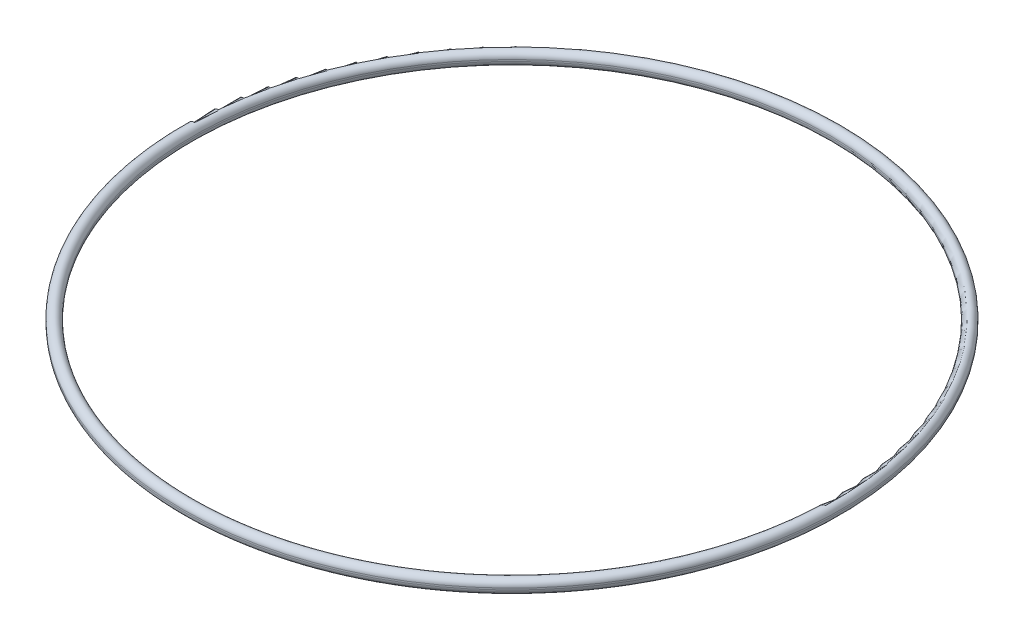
from build123d import *


with BuildPart() as part:
    # Sketch1 → Revolve1 (revolve)
    with BuildSketch(Plane.XY, mode=Mode.PRIVATE) as revolve1_sk:
        with BuildLine():
            Line((36.909375, 0), (36.909375, 0.1905))
            ThreePointArc((36.909375, 0.1905), (37.5840625, 0.8651875), (38.25875, 0.1905))
            Line((38.25875, 0.1905), (38.25875, 0))
            ThreePointArc((38.25875, 0), (37.5840625, -0.6746875), (36.909375, 0))
        make_face()
    revolve(revolve1_sk.sketch.rotate(Axis((0, 0, 0), (0, 1, 0)), 90), axis=Axis((0, 0, 0), (0, 1, 0)))


solid = part.part
